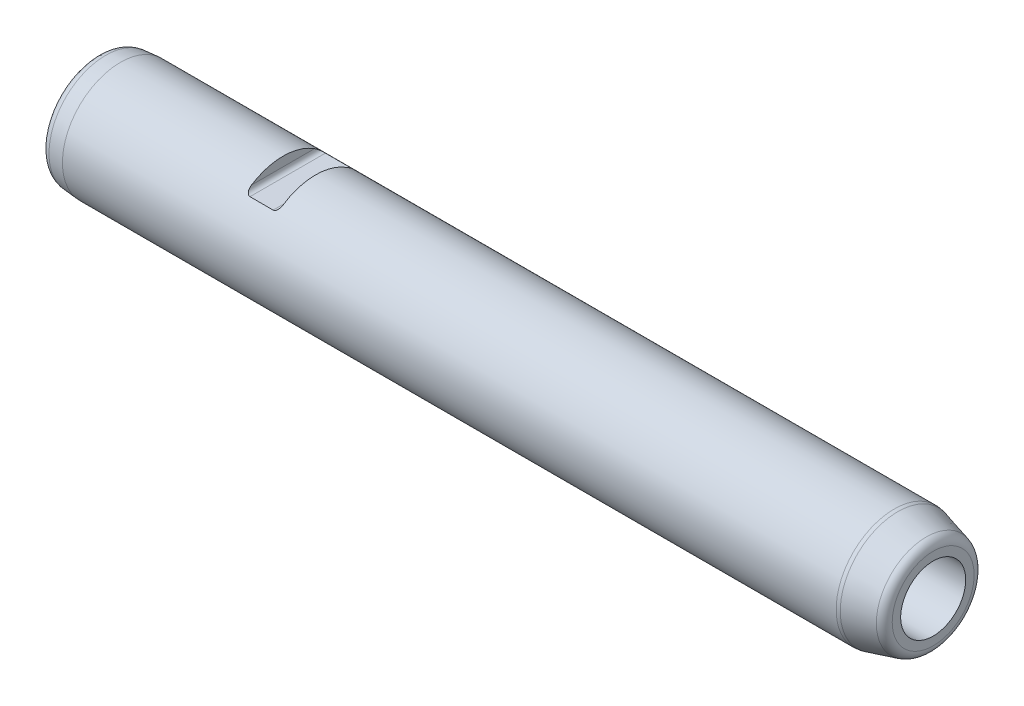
ISO-10303-21;
HEADER;
FILE_DESCRIPTION(('STEP AP214'),'2;1');
FILE_NAME('part.step','',(''),(''),'','','');
FILE_SCHEMA(('AUTOMOTIVE_DESIGN { 1 0 10303 214 1 1 1 1 }'));
ENDSEC;
DATA;
#1=APPLICATION_CONTEXT('core data for automotive mechanical design processes');
#2=APPLICATION_PROTOCOL_DEFINITION('international standard','automotive_design',2000,#1);
#3=PRODUCT_CONTEXT('',#1,'mechanical');
#4=PRODUCT('Part','Part','',(#3));
#5=PRODUCT_RELATED_PRODUCT_CATEGORY('part','',(#4));
#6=PRODUCT_DEFINITION_FORMATION('','',#4);
#7=PRODUCT_DEFINITION_CONTEXT('part definition',#1,'design');
#8=PRODUCT_DEFINITION('design','',#6,#7);
#9=PRODUCT_DEFINITION_SHAPE('','',#8);
#10=(LENGTH_UNIT() NAMED_UNIT(*) SI_UNIT(.MILLI.,.METRE.));
#11=(NAMED_UNIT(*) PLANE_ANGLE_UNIT() SI_UNIT($,.RADIAN.));
#12=(NAMED_UNIT(*) SI_UNIT($,.STERADIAN.) SOLID_ANGLE_UNIT());
#13=UNCERTAINTY_MEASURE_WITH_UNIT(LENGTH_MEASURE(1.E-05),#10,'distance_accuracy_value','');
#14=(GEOMETRIC_REPRESENTATION_CONTEXT(3) GLOBAL_UNCERTAINTY_ASSIGNED_CONTEXT((#13)) GLOBAL_UNIT_ASSIGNED_CONTEXT((#10,
#11,#12)) REPRESENTATION_CONTEXT('',''));
#15=CARTESIAN_POINT('',(0.,0.,0.));
#16=DIRECTION('',(0.,0.,1.));
#17=DIRECTION('',(1.,0.,0.));
#18=AXIS2_PLACEMENT_3D('',#15,#16,#17);
#19=CARTESIAN_POINT('',(0.,0.,0.));
#20=DIRECTION('',(1.,0.,0.));
#21=DIRECTION('',(0.,0.,-1.));
#22=AXIS2_PLACEMENT_3D('',#19,#20,#21);
#23=PLANE('',#22);
#24=CARTESIAN_POINT('',(0.,0.,0.));
#25=DIRECTION('',(1.,0.,0.));
#26=DIRECTION('',(0.,0.,-1.));
#27=AXIS2_PLACEMENT_3D('',#24,#25,#26);
#28=CIRCLE('',#27,10.2298943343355);
#29=CARTESIAN_POINT('',(0.,0.,-10.2298943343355));
#30=VERTEX_POINT('',#29);
#31=EDGE_CURVE('E158',#30,#30,#28,.F.);
#32=ORIENTED_EDGE('',*,*,#31,.T.);
#33=EDGE_LOOP('',(#32));
#34=FACE_BOUND('',#33,.T.);
#35=ADVANCED_FACE('F15',(#34),#23,.F.);
#36=CARTESIAN_POINT('',(0.,0.,0.));
#37=DIRECTION('',(-1.,0.,0.));
#38=DIRECTION('',(0.,0.,1.));
#39=AXIS2_PLACEMENT_3D('',#36,#37,#38);
#40=CYLINDRICAL_SURFACE('',#39,12.5);
#41=CARTESIAN_POINT('',(47.,0.,0.));
#42=DIRECTION('',(1.,0.,0.));
#43=DIRECTION('',(0.,1.,0.));
#44=AXIS2_PLACEMENT_3D('',#41,#42,#43);
#45=CIRCLE('',#44,12.5);
#46=CARTESIAN_POINT('',(47.,10.5,-6.78232998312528));
#47=VERTEX_POINT('',#46);
#48=CARTESIAN_POINT('',(47.,10.5,6.78232998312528));
#49=VERTEX_POINT('',#48);
#50=EDGE_CURVE('E9',#47,#49,#45,.T.);
#51=ORIENTED_EDGE('',*,*,#50,.T.);
#52=CARTESIAN_POINT('',(47.,10.5,6.78232998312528));
#53=CARTESIAN_POINT('',(46.9999581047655,10.4555157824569,6.85121493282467));
#54=CARTESIAN_POINT('',(46.9970253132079,10.410298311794,6.91971417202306));
#55=CARTESIAN_POINT('',(46.9845078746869,10.3185437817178,7.0558038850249));
#56=CARTESIAN_POINT('',(46.9748826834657,10.2720003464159,7.12338624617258));
#57=CARTESIAN_POINT('',(46.9479069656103,10.1776540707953,7.25756072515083));
#58=CARTESIAN_POINT('',(46.930452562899,10.1298427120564,7.32412665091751));
#59=CARTESIAN_POINT('',(46.8865917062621,10.0344838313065,7.45423371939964));
#60=CARTESIAN_POINT('',(46.86021088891,9.98693594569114,7.51778293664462));
#61=CARTESIAN_POINT('',(46.8046402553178,9.90470385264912,7.62563193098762));
#62=CARTESIAN_POINT('',(46.777703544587,9.8697098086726,7.6708472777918));
#63=CARTESIAN_POINT('',(46.7170192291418,9.80145467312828,7.75786906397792));
#64=CARTESIAN_POINT('',(46.6832802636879,9.76819145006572,7.79967973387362));
#65=CARTESIAN_POINT('',(46.6076531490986,9.70423155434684,7.87911941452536));
#66=CARTESIAN_POINT('',(46.565660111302,9.67357608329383,7.91668360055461));
#67=CARTESIAN_POINT('',(46.4732893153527,9.61745222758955,7.98477000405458));
#68=CARTESIAN_POINT('',(46.4229383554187,9.59196782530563,8.01531400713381));
#69=CARTESIAN_POINT('',(46.3349118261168,9.55704784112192,8.05687775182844));
#70=CARTESIAN_POINT('',(46.2996164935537,9.54518424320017,8.07091660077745));
#71=CARTESIAN_POINT('',(46.2265400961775,9.52526677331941,8.09441352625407));
#72=CARTESIAN_POINT('',(46.1887645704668,9.51720472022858,8.1038814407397));
#73=CARTESIAN_POINT('',(46.125634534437,9.50761134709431,8.11513157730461));
#74=CARTESIAN_POINT('',(46.1007411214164,9.50477205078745,8.11845570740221));
#75=CARTESIAN_POINT('',(46.0505720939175,9.50096008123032,8.12291573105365));
#76=CARTESIAN_POINT('',(46.025295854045,9.49999089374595,8.12404753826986));
#77=CARTESIAN_POINT('',(46.,9.5,8.12403840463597));
#78=B_SPLINE_CURVE_WITH_KNOTS('',3,(#52,#53,#54,#55,#56,#57,#58,#59,#60,#61,#62,#63,#64,#65,#66,
#67,#68,#69,#70,#71,#72,#73,#74,#75,#76,#77),.UNSPECIFIED.,.F.,.F.,(4,2,2,2,2,2,2,2,2,2,2,2,4),
(0.,0.24605820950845,0.493620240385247,0.74456874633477,0.994802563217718,1.18402559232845,
1.37300979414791,1.56457202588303,1.75553150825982,1.87448018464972,1.99317169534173,
2.0688393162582,2.14464784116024),.UNSPECIFIED.);
#79=CARTESIAN_POINT('',(46.,9.5,8.12403840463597));
#80=VERTEX_POINT('',#79);
#81=EDGE_CURVE('E23',#49,#80,#78,.T.);
#82=ORIENTED_EDGE('',*,*,#81,.T.);
#83=DIRECTION('',(-1.,0.,0.));
#84=VECTOR('',#83,1.);
#85=CARTESIAN_POINT('',(0.,9.5,8.12403840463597));
#86=LINE('',#85,#84);
#87=CARTESIAN_POINT('',(41.,9.5,8.12403840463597));
#88=VERTEX_POINT('',#87);
#89=EDGE_CURVE('E72',#80,#88,#86,.T.);
#90=ORIENTED_EDGE('',*,*,#89,.T.);
#91=CARTESIAN_POINT('',(41.,9.5,8.12403840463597));
#92=CARTESIAN_POINT('',(40.978835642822,9.49999671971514,8.12404158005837));
#93=CARTESIAN_POINT('',(40.9576850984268,9.5006725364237,8.12325201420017));
#94=CARTESIAN_POINT('',(40.9156013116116,9.50334558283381,8.1201249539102));
#95=CARTESIAN_POINT('',(40.8946678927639,9.505341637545,8.11778883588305));
#96=CARTESIAN_POINT('',(40.8328502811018,9.51320231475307,8.10857872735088));
#97=CARTESIAN_POINT('',(40.7925040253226,9.52094115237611,8.09950120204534));
#98=CARTESIAN_POINT('',(40.7146719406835,9.54072852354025,8.07618268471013));
#99=CARTESIAN_POINT('',(40.6771773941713,9.55276322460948,8.06195826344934));
#100=CARTESIAN_POINT('',(40.6054343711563,9.58032645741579,8.0291846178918));
#101=CARTESIAN_POINT('',(40.5711943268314,9.5958637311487,8.01062456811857));
#102=CARTESIAN_POINT('',(40.4917854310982,9.63714412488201,7.9609607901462));
#103=CARTESIAN_POINT('',(40.448568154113,9.66434565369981,7.92795753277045));
#104=CARTESIAN_POINT('',(40.3694527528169,9.72229590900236,7.85678601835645));
#105=CARTESIAN_POINT('',(40.3335669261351,9.753050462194,7.81860925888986));
#106=CARTESIAN_POINT('',(40.2512700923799,9.83347969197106,7.71743057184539));
#107=CARTESIAN_POINT('',(40.2093035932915,9.88457159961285,7.65196255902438));
#108=CARTESIAN_POINT('',(40.1382719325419,9.98871039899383,7.51552448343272));
#109=CARTESIAN_POINT('',(40.1092691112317,10.0417654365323,7.4445297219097));
#110=CARTESIAN_POINT('',(40.0704145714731,10.1294624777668,7.32444205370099));
#111=CARTESIAN_POINT('',(40.0574102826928,10.1640932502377,7.27631582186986));
#112=CARTESIAN_POINT('',(40.0355900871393,10.2331195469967,7.17891541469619));
#113=CARTESIAN_POINT('',(40.0267766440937,10.2675149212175,7.12964058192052));
#114=CARTESIAN_POINT('',(40.013057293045,10.3353084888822,7.03099741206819));
#115=CARTESIAN_POINT('',(40.0080943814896,10.3687138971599,6.98164172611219));
#116=CARTESIAN_POINT('',(40.0015738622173,10.4348693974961,6.88237363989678));
#117=CARTESIAN_POINT('',(40.0000111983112,10.467620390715,6.8324621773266));
#118=CARTESIAN_POINT('',(40.,10.5,6.78232998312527));
#119=B_SPLINE_CURVE_WITH_KNOTS('',3,(#91,#92,#93,#94,#95,#96,#97,#98,#99,#100,#101,#102,#103,
#104,#105,#106,#107,#108,#109,#110,#111,#112,#113,#114,#115,#116,#117,#118),.UNSPECIFIED.,.F.,
.F.,(4,2,2,2,2,2,2,2,2,2,2,2,2,4),(0.,0.0634415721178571,0.126826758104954,0.252285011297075,
0.377342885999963,0.502716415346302,0.684101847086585,0.865789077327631,1.14338996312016,
1.42231179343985,1.60426248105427,1.7863200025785,1.9656279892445,2.14466916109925),.UNSPECIFIED.);
#120=CARTESIAN_POINT('',(40.,10.5,6.78232998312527));
#121=VERTEX_POINT('',#120);
#122=EDGE_CURVE('E64',#88,#121,#119,.T.);
#123=ORIENTED_EDGE('',*,*,#122,.T.);
#124=CARTESIAN_POINT('',(40.,0.,0.));
#125=DIRECTION('',(-1.,0.,0.));
#126=DIRECTION('',(0.,0.,1.));
#127=AXIS2_PLACEMENT_3D('',#124,#125,#126);
#128=CIRCLE('',#127,12.5);
#129=CARTESIAN_POINT('',(40.,10.5,-6.78232998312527));
#130=VERTEX_POINT('',#129);
#131=EDGE_CURVE('E53',#121,#130,#128,.T.);
#132=ORIENTED_EDGE('',*,*,#131,.T.);
#133=CARTESIAN_POINT('',(40.,10.5,-6.78232998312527));
#134=CARTESIAN_POINT('',(40.0000418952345,10.4555157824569,-6.85121493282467));
#135=CARTESIAN_POINT('',(40.0029746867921,10.410298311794,-6.91971417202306));
#136=CARTESIAN_POINT('',(40.0154921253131,10.3185437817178,-7.05580388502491));
#137=CARTESIAN_POINT('',(40.0251173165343,10.2720003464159,-7.1233862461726));
#138=CARTESIAN_POINT('',(40.0520930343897,10.1776540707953,-7.25756072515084));
#139=CARTESIAN_POINT('',(40.0695474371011,10.1298427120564,-7.32412665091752));
#140=CARTESIAN_POINT('',(40.1134082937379,10.0344838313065,-7.45423371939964));
#141=CARTESIAN_POINT('',(40.13978911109,9.98693594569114,-7.51778293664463));
#142=CARTESIAN_POINT('',(40.1953597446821,9.90470385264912,-7.62563193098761));
#143=CARTESIAN_POINT('',(40.2222964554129,9.86970980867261,-7.67084727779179));
#144=CARTESIAN_POINT('',(40.2829807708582,9.80145467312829,-7.7578690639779));
#145=CARTESIAN_POINT('',(40.3167197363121,9.76819145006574,-7.7996797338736));
#146=CARTESIAN_POINT('',(40.3923468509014,9.70423155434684,-7.87911941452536));
#147=CARTESIAN_POINT('',(40.434339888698,9.67357608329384,-7.9166836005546));
#148=CARTESIAN_POINT('',(40.5267106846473,9.61745222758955,-7.98477000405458));
#149=CARTESIAN_POINT('',(40.5770616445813,9.59196782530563,-8.01531400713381));
#150=CARTESIAN_POINT('',(40.6650881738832,9.55704784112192,-8.05687775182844));
#151=CARTESIAN_POINT('',(40.7003835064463,9.54518424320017,-8.07091660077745));
#152=CARTESIAN_POINT('',(40.7734599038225,9.52526677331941,-8.09441352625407));
#153=CARTESIAN_POINT('',(40.8112354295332,9.51720472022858,-8.1038814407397));
#154=CARTESIAN_POINT('',(40.874365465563,9.50761134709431,-8.11513157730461));
#155=CARTESIAN_POINT('',(40.8992588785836,9.50477205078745,-8.11845570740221));
#156=CARTESIAN_POINT('',(40.9494279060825,9.50096008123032,-8.12291573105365));
#157=CARTESIAN_POINT('',(40.974704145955,9.49999089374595,-8.12404753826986));
#158=CARTESIAN_POINT('',(41.,9.5,-8.12403840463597));
#159=B_SPLINE_CURVE_WITH_KNOTS('',3,(#133,#134,#135,#136,#137,#138,#139,#140,#141,#142,#143,
#144,#145,#146,#147,#148,#149,#150,#151,#152,#153,#154,#155,#156,#157,#158),.UNSPECIFIED.,.F.,
.F.,(4,2,2,2,2,2,2,2,2,2,2,2,4),(0.,0.246058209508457,0.493620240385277,0.744568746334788,
0.994802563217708,1.18402559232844,1.37300979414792,1.56457202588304,1.75553150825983,
1.87448018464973,1.99317169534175,2.06883931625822,2.14464784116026),.UNSPECIFIED.);
#160=CARTESIAN_POINT('',(41.,9.5,-8.12403840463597));
#161=VERTEX_POINT('',#160);
#162=EDGE_CURVE('E58',#130,#161,#159,.T.);
#163=ORIENTED_EDGE('',*,*,#162,.T.);
#164=DIRECTION('',(-1.,0.,0.));
#165=VECTOR('',#164,1.);
#166=CARTESIAN_POINT('',(0.,9.5,-8.12403840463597));
#167=LINE('',#166,#165);
#168=CARTESIAN_POINT('',(46.,9.5,-8.12403840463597));
#169=VERTEX_POINT('',#168);
#170=EDGE_CURVE('E73',#161,#169,#167,.F.);
#171=ORIENTED_EDGE('',*,*,#170,.T.);
#172=CARTESIAN_POINT('',(46.,9.5,-8.12403840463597));
#173=CARTESIAN_POINT('',(46.021164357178,9.49999671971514,-8.12404158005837));
#174=CARTESIAN_POINT('',(46.0423149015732,9.5006725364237,-8.12325201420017));
#175=CARTESIAN_POINT('',(46.0843986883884,9.50334558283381,-8.1201249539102));
#176=CARTESIAN_POINT('',(46.1053321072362,9.50534163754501,-8.11778883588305));
#177=CARTESIAN_POINT('',(46.1671497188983,9.51320231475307,-8.10857872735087));
#178=CARTESIAN_POINT('',(46.2074959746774,9.52094115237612,-8.09950120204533));
#179=CARTESIAN_POINT('',(46.2853280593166,9.54072852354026,-8.07618268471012));
#180=CARTESIAN_POINT('',(46.3228226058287,9.55276322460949,-8.06195826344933));
#181=CARTESIAN_POINT('',(46.3945656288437,9.5803264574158,-8.02918461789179));
#182=CARTESIAN_POINT('',(46.4288056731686,9.5958637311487,-8.01062456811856));
#183=CARTESIAN_POINT('',(46.5082145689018,9.63714412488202,-7.96096079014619));
#184=CARTESIAN_POINT('',(46.551431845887,9.66434565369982,-7.92795753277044));
#185=CARTESIAN_POINT('',(46.6305472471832,9.72229590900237,-7.85678601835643));
#186=CARTESIAN_POINT('',(46.666433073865,9.753050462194,-7.81860925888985));
#187=CARTESIAN_POINT('',(46.7487299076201,9.83347969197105,-7.71743057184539));
#188=CARTESIAN_POINT('',(46.7906964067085,9.88457159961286,-7.65196255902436));
#189=CARTESIAN_POINT('',(46.8617280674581,9.98871039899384,-7.51552448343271));
#190=CARTESIAN_POINT('',(46.8907308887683,10.0417654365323,-7.4445297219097));
#191=CARTESIAN_POINT('',(46.929585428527,10.1294624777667,-7.32444205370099));
#192=CARTESIAN_POINT('',(46.9425897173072,10.1640932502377,-7.27631582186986));
#193=CARTESIAN_POINT('',(46.9644099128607,10.2331195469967,-7.17891541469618));
#194=CARTESIAN_POINT('',(46.9732233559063,10.2675149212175,-7.12964058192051));
#195=CARTESIAN_POINT('',(46.986942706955,10.3353084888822,-7.03099741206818));
#196=CARTESIAN_POINT('',(46.9919056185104,10.3687138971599,-6.98164172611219));
#197=CARTESIAN_POINT('',(46.9984261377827,10.4348693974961,-6.88237363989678));
#198=CARTESIAN_POINT('',(46.9999888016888,10.467620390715,-6.8324621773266));
#199=CARTESIAN_POINT('',(47.,10.5,-6.78232998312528));
#200=B_SPLINE_CURVE_WITH_KNOTS('',3,(#172,#173,#174,#175,#176,#177,#178,#179,#180,#181,#182,
#183,#184,#185,#186,#187,#188,#189,#190,#191,#192,#193,#194,#195,#196,#197,#198,#199),
.UNSPECIFIED.,.F.,.F.,(4,2,2,2,2,2,2,2,2,2,2,2,2,4),(0.,0.0634415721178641,0.126826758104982,
0.252285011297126,0.377342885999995,0.502716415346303,0.684101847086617,0.865789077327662,
1.14338996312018,1.42231179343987,1.60426248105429,1.78632000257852,1.96562798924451,
2.14466916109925),.UNSPECIFIED.);
#201=EDGE_CURVE('E207',#169,#47,#200,.T.);
#202=ORIENTED_EDGE('',*,*,#201,.T.);
#203=EDGE_LOOP('',(#51,#82,#90,#123,#132,#163,#171,#202));
#204=FACE_BOUND('',#203,.T.);
#205=CARTESIAN_POINT('',(5.00000000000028,0.,0.));
#206=DIRECTION('',(1.,0.,0.));
#207=DIRECTION('',(0.,0.,-1.));
#208=AXIS2_PLACEMENT_3D('',#205,#206,#207);
#209=CIRCLE('',#208,12.5);
#210=CARTESIAN_POINT('',(5.00000000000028,0.,-12.5));
#211=VERTEX_POINT('',#210);
#212=EDGE_CURVE('E157',#211,#211,#209,.T.);
#213=ORIENTED_EDGE('',*,*,#212,.T.);
#214=EDGE_LOOP('',(#213));
#215=FACE_BOUND('',#214,.T.);
#216=CARTESIAN_POINT('',(171.605042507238,0.,0.));
#217=DIRECTION('',(1.,0.,0.));
#218=DIRECTION('',(0.,0.,-1.));
#219=AXIS2_PLACEMENT_3D('',#216,#217,#218);
#220=CIRCLE('',#219,12.5);
#221=CARTESIAN_POINT('',(171.605042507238,0.,-12.5));
#222=VERTEX_POINT('',#221);
#223=EDGE_CURVE('E175',#222,#222,#220,.F.);
#224=ORIENTED_EDGE('',*,*,#223,.T.);
#225=EDGE_LOOP('',(#224));
#226=FACE_BOUND('',#225,.T.);
#227=ADVANCED_FACE('F69',(#204,#215,#226),#40,.T.);
#228=CARTESIAN_POINT('',(180.,0.,0.));
#229=DIRECTION('',(-1.,0.,0.));
#230=DIRECTION('',(0.,0.,1.));
#231=AXIS2_PLACEMENT_3D('',#228,#229,#230);
#232=CONICAL_SURFACE('',#231,10.356406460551,0.26179938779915);
#233=CARTESIAN_POINT('',(178.517638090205,0.,0.));
#234=DIRECTION('',(1.,0.,0.));
#235=DIRECTION('',(0.,0.,-1.));
#236=AXIS2_PLACEMENT_3D('',#233,#234,#235);
#237=CIRCLE('',#236,10.7536041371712);
#238=CARTESIAN_POINT('',(178.517638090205,0.,-10.7536041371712));
#239=VERTEX_POINT('',#238);
#240=EDGE_CURVE('E163',#239,#239,#237,.F.);
#241=ORIENTED_EDGE('',*,*,#240,.T.);
#242=EDGE_LOOP('',(#241));
#243=FACE_BOUND('',#242,.T.);
#244=CARTESIAN_POINT('',(172.381499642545,0.,0.));
#245=DIRECTION('',(1.,0.,0.));
#246=DIRECTION('',(0.,0.,-1.));
#247=AXIS2_PLACEMENT_3D('',#244,#245,#246);
#248=CIRCLE('',#247,12.3977774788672);
#249=CARTESIAN_POINT('',(172.381499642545,0.,-12.3977774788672));
#250=VERTEX_POINT('',#249);
#251=EDGE_CURVE('E188',#250,#250,#248,.T.);
#252=ORIENTED_EDGE('',*,*,#251,.T.);
#253=EDGE_LOOP('',(#252));
#254=FACE_BOUND('',#253,.T.);
#255=ADVANCED_FACE('F120',(#243,#254),#232,.T.);
#256=CARTESIAN_POINT('',(180.,10.356406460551,0.));
#257=DIRECTION('',(-1.,0.,0.));
#258=DIRECTION('',(0.,0.,1.));
#259=AXIS2_PLACEMENT_3D('',#256,#257,#258);
#260=PLANE('',#259);
#261=CARTESIAN_POINT('',(180.,0.,0.));
#262=DIRECTION('',(1.,0.,0.));
#263=DIRECTION('',(0.,0.,-1.));
#264=AXIS2_PLACEMENT_3D('',#261,#262,#263);
#265=CIRCLE('',#264,7.);
#266=CARTESIAN_POINT('',(180.,0.,-7.));
#267=VERTEX_POINT('',#266);
#268=EDGE_CURVE('E178',#267,#267,#265,.T.);
#269=ORIENTED_EDGE('',*,*,#268,.F.);
#270=EDGE_LOOP('',(#269));
#271=FACE_BOUND('',#270,.T.);
#272=CARTESIAN_POINT('',(180.,0.,0.));
#273=DIRECTION('',(-1.,0.,0.));
#274=DIRECTION('',(0.,0.,1.));
#275=AXIS2_PLACEMENT_3D('',#272,#273,#274);
#276=CIRCLE('',#275,8.8217524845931);
#277=CARTESIAN_POINT('',(180.,0.,8.8217524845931));
#278=VERTEX_POINT('',#277);
#279=EDGE_CURVE('E159',#278,#278,#276,.F.);
#280=ORIENTED_EDGE('',*,*,#279,.T.);
#281=EDGE_LOOP('',(#280));
#282=FACE_BOUND('',#281,.T.);
#283=ADVANCED_FACE('F117',(#271,#282),#260,.F.);
#284=CARTESIAN_POINT('',(171.605042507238,0.,0.));
#285=DIRECTION('',(1.,0.,0.));
#286=DIRECTION('',(0.,0.,-1.));
#287=AXIS2_PLACEMENT_3D('',#284,#285,#286);
#288=TOROIDAL_SURFACE('',#287,9.5,3.);
#289=ORIENTED_EDGE('',*,*,#251,.F.);
#290=EDGE_LOOP('',(#289));
#291=FACE_BOUND('',#290,.T.);
#292=ORIENTED_EDGE('',*,*,#223,.F.);
#293=EDGE_LOOP('',(#292));
#294=FACE_BOUND('',#293,.T.);
#295=ADVANCED_FACE('F119',(#291,#294),#288,.T.);
#296=CARTESIAN_POINT('',(178.,0.,0.));
#297=DIRECTION('',(-1.,0.,0.));
#298=DIRECTION('',(0.,0.,1.));
#299=AXIS2_PLACEMENT_3D('',#296,#297,#298);
#300=TOROIDAL_SURFACE('',#299,8.8217524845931,2.);
#301=ORIENTED_EDGE('',*,*,#279,.F.);
#302=EDGE_LOOP('',(#301));
#303=FACE_BOUND('',#302,.T.);
#304=ORIENTED_EDGE('',*,*,#240,.F.);
#305=EDGE_LOOP('',(#304));
#306=FACE_BOUND('',#305,.T.);
#307=ADVANCED_FACE('F140',(#303,#306),#300,.T.);
#308=CARTESIAN_POINT('',(0.,0.,0.));
#309=DIRECTION('',(1.,0.,0.));
#310=DIRECTION('',(0.,0.,-1.));
#311=AXIS2_PLACEMENT_3D('',#308,#309,#310);
#312=CONICAL_SURFACE('',#311,12.0625566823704,0.0872664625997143);
#313=CARTESIAN_POINT('',(1.82568851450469,0.,0.));
#314=DIRECTION('',(1.,0.,0.));
#315=DIRECTION('',(0.,0.,-1.));
#316=AXIS2_PLACEMENT_3D('',#313,#314,#315);
#317=CIRCLE('',#316,12.222283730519);
#318=CARTESIAN_POINT('',(1.82568851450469,0.,-12.222283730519));
#319=VERTEX_POINT('',#318);
#320=EDGE_CURVE('E59',#319,#319,#317,.T.);
#321=ORIENTED_EDGE('',*,*,#320,.T.);
#322=EDGE_LOOP('',(#321));
#323=FACE_BOUND('',#322,.T.);
#324=ORIENTED_EDGE('',*,*,#212,.F.);
#325=EDGE_LOOP('',(#324));
#326=FACE_BOUND('',#325,.T.);
#327=ADVANCED_FACE('F143',(#323,#326),#312,.T.);
#328=CARTESIAN_POINT('',(2.,0.,0.));
#329=DIRECTION('',(1.,0.,0.));
#330=DIRECTION('',(0.,0.,-1.));
#331=AXIS2_PLACEMENT_3D('',#328,#329,#330);
#332=TOROIDAL_SURFACE('',#331,10.2298943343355,2.);
#333=ORIENTED_EDGE('',*,*,#320,.F.);
#334=EDGE_LOOP('',(#333));
#335=FACE_BOUND('',#334,.T.);
#336=ORIENTED_EDGE('',*,*,#31,.F.);
#337=EDGE_LOOP('',(#336));
#338=FACE_BOUND('',#337,.T.);
#339=ADVANCED_FACE('F17',(#335,#338),#332,.T.);
#340=CARTESIAN_POINT('',(156.,0.,0.));
#341=DIRECTION('',(1.,0.,0.));
#342=DIRECTION('',(0.,0.,-1.));
#343=AXIS2_PLACEMENT_3D('',#340,#341,#342);
#344=PLANE('',#343);
#345=CARTESIAN_POINT('',(156.,0.,0.));
#346=DIRECTION('',(1.,0.,0.));
#347=DIRECTION('',(0.,0.,-1.));
#348=AXIS2_PLACEMENT_3D('',#345,#346,#347);
#349=CIRCLE('',#348,7.);
#350=CARTESIAN_POINT('',(156.,0.,-7.));
#351=VERTEX_POINT('',#350);
#352=EDGE_CURVE('E171',#351,#351,#349,.T.);
#353=ORIENTED_EDGE('',*,*,#352,.T.);
#354=EDGE_LOOP('',(#353));
#355=FACE_BOUND('',#354,.T.);
#356=CARTESIAN_POINT('',(156.,0.,0.));
#357=DIRECTION('',(1.,0.,0.));
#358=DIRECTION('',(0.,0.,-1.));
#359=AXIS2_PLACEMENT_3D('',#356,#357,#358);
#360=CIRCLE('',#359,5.1);
#361=CARTESIAN_POINT('',(156.,0.,-5.1));
#362=VERTEX_POINT('',#361);
#363=EDGE_CURVE('E168',#362,#362,#360,.F.);
#364=ORIENTED_EDGE('',*,*,#363,.T.);
#365=EDGE_LOOP('',(#364));
#366=FACE_BOUND('',#365,.T.);
#367=ADVANCED_FACE('F101',(#355,#366),#344,.T.);
#368=CARTESIAN_POINT('',(156.,0.,0.));
#369=DIRECTION('',(1.,0.,0.));
#370=DIRECTION('',(0.,0.,-1.));
#371=AXIS2_PLACEMENT_3D('',#368,#369,#370);
#372=CYLINDRICAL_SURFACE('',#371,7.);
#373=ORIENTED_EDGE('',*,*,#352,.F.);
#374=EDGE_LOOP('',(#373));
#375=FACE_BOUND('',#374,.T.);
#376=ORIENTED_EDGE('',*,*,#268,.T.);
#377=EDGE_LOOP('',(#376));
#378=FACE_BOUND('',#377,.T.);
#379=ADVANCED_FACE('F104',(#375,#378),#372,.F.);
#380=CARTESIAN_POINT('',(150.,0.,0.));
#381=DIRECTION('',(1.,0.,0.));
#382=DIRECTION('',(0.,0.,-1.));
#383=AXIS2_PLACEMENT_3D('',#380,#381,#382);
#384=CONICAL_SURFACE('',#383,5.1,1.0471975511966);
#385=CARTESIAN_POINT('',(147.055513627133,0.,0.));
#386=VERTEX_POINT('',#385);
#387=VERTEX_LOOP('',#386);
#388=FACE_BOUND('',#387,.T.);
#389=CARTESIAN_POINT('',(150.,0.,0.));
#390=DIRECTION('',(1.,0.,0.));
#391=DIRECTION('',(0.,0.,-1.));
#392=AXIS2_PLACEMENT_3D('',#389,#390,#391);
#393=CIRCLE('',#392,5.1);
#394=CARTESIAN_POINT('',(150.,0.,-5.1));
#395=VERTEX_POINT('',#394);
#396=EDGE_CURVE('E170',#395,#395,#393,.T.);
#397=ORIENTED_EDGE('',*,*,#396,.T.);
#398=EDGE_LOOP('',(#397));
#399=FACE_BOUND('',#398,.T.);
#400=ADVANCED_FACE('F108',(#388,#399),#384,.F.);
#401=CARTESIAN_POINT('',(180.,0.,0.));
#402=DIRECTION('',(1.,0.,0.));
#403=DIRECTION('',(0.,0.,-1.));
#404=AXIS2_PLACEMENT_3D('',#401,#402,#403);
#405=CYLINDRICAL_SURFACE('',#404,5.1);
#406=ORIENTED_EDGE('',*,*,#396,.F.);
#407=EDGE_LOOP('',(#406));
#408=FACE_BOUND('',#407,.T.);
#409=ORIENTED_EDGE('',*,*,#363,.F.);
#410=EDGE_LOOP('',(#409));
#411=FACE_BOUND('',#410,.T.);
#412=ADVANCED_FACE('F110',(#408,#411),#405,.F.);
#413=CARTESIAN_POINT('',(47.,10.5,-12.5));
#414=DIRECTION('',(1.,0.,0.));
#415=DIRECTION('',(0.,1.,0.));
#416=AXIS2_PLACEMENT_3D('',#413,#414,#415);
#417=PLANE('',#416);
#418=ORIENTED_EDGE('',*,*,#50,.F.);
#419=DIRECTION('',(0.,0.,1.));
#420=VECTOR('',#419,1.);
#421=CARTESIAN_POINT('',(47.,10.5,-12.5));
#422=LINE('',#421,#420);
#423=EDGE_CURVE('E182',#47,#49,#422,.T.);
#424=ORIENTED_EDGE('',*,*,#423,.T.);
#425=EDGE_LOOP('',(#418,#424));
#426=FACE_BOUND('',#425,.T.);
#427=ADVANCED_FACE('F113',(#426),#417,.F.);
#428=CARTESIAN_POINT('',(46.,10.5,-12.5));
#429=DIRECTION('',(0.,0.,1.));
#430=DIRECTION('',(1.,0.,0.));
#431=AXIS2_PLACEMENT_3D('',#428,#429,#430);
#432=CYLINDRICAL_SURFACE('',#431,1.);
#433=ORIENTED_EDGE('',*,*,#423,.F.);
#434=ORIENTED_EDGE('',*,*,#201,.F.);
#435=DIRECTION('',(0.,0.,1.));
#436=VECTOR('',#435,1.);
#437=CARTESIAN_POINT('',(46.,9.5,-12.5));
#438=LINE('',#437,#436);
#439=EDGE_CURVE('E197',#169,#80,#438,.T.);
#440=ORIENTED_EDGE('',*,*,#439,.T.);
#441=ORIENTED_EDGE('',*,*,#81,.F.);
#442=EDGE_LOOP('',(#433,#434,#440,#441));
#443=FACE_BOUND('',#442,.T.);
#444=ADVANCED_FACE('F206',(#443),#432,.F.);
#445=CARTESIAN_POINT('',(41.,9.5,-12.5));
#446=DIRECTION('',(0.,-1.,0.));
#447=DIRECTION('',(0.,0.,-1.));
#448=AXIS2_PLACEMENT_3D('',#445,#446,#447);
#449=PLANE('',#448);
#450=ORIENTED_EDGE('',*,*,#439,.F.);
#451=ORIENTED_EDGE('',*,*,#170,.F.);
#452=DIRECTION('',(0.,0.,1.));
#453=VECTOR('',#452,1.);
#454=CARTESIAN_POINT('',(41.,9.5,-12.5));
#455=LINE('',#454,#453);
#456=EDGE_CURVE('E66',#161,#88,#455,.T.);
#457=ORIENTED_EDGE('',*,*,#456,.T.);
#458=ORIENTED_EDGE('',*,*,#89,.F.);
#459=EDGE_LOOP('',(#450,#451,#457,#458));
#460=FACE_BOUND('',#459,.T.);
#461=ADVANCED_FACE('F96',(#460),#449,.F.);
#462=CARTESIAN_POINT('',(41.,10.5,-12.5));
#463=DIRECTION('',(0.,0.,1.));
#464=DIRECTION('',(1.,0.,0.));
#465=AXIS2_PLACEMENT_3D('',#462,#463,#464);
#466=CYLINDRICAL_SURFACE('',#465,1.);
#467=ORIENTED_EDGE('',*,*,#456,.F.);
#468=ORIENTED_EDGE('',*,*,#162,.F.);
#469=DIRECTION('',(0.,0.,1.));
#470=VECTOR('',#469,1.);
#471=CARTESIAN_POINT('',(40.,10.5,-12.5));
#472=LINE('',#471,#470);
#473=EDGE_CURVE('E29',#130,#121,#472,.T.);
#474=ORIENTED_EDGE('',*,*,#473,.T.);
#475=ORIENTED_EDGE('',*,*,#122,.F.);
#476=EDGE_LOOP('',(#467,#468,#474,#475));
#477=FACE_BOUND('',#476,.T.);
#478=ADVANCED_FACE('F63',(#477),#466,.F.);
#479=CARTESIAN_POINT('',(40.,12.5,-12.5));
#480=DIRECTION('',(-1.,0.,0.));
#481=DIRECTION('',(0.,0.,1.));
#482=AXIS2_PLACEMENT_3D('',#479,#480,#481);
#483=PLANE('',#482);
#484=ORIENTED_EDGE('',*,*,#473,.F.);
#485=ORIENTED_EDGE('',*,*,#131,.F.);
#486=EDGE_LOOP('',(#484,#485));
#487=FACE_BOUND('',#486,.T.);
#488=ADVANCED_FACE('F54',(#487),#483,.F.);
#489=CLOSED_SHELL('',(#35,#227,#255,#283,#295,#307,#327,#339,#367,#379,#400,#412,#427,#444,#461,
#478,#488));
#490=MANIFOLD_SOLID_BREP('B1',#489);
#491=ADVANCED_BREP_SHAPE_REPRESENTATION('',(#18,#490),#14);
#492=SHAPE_DEFINITION_REPRESENTATION(#9,#491);
ENDSEC;
END-ISO-10303-21;
